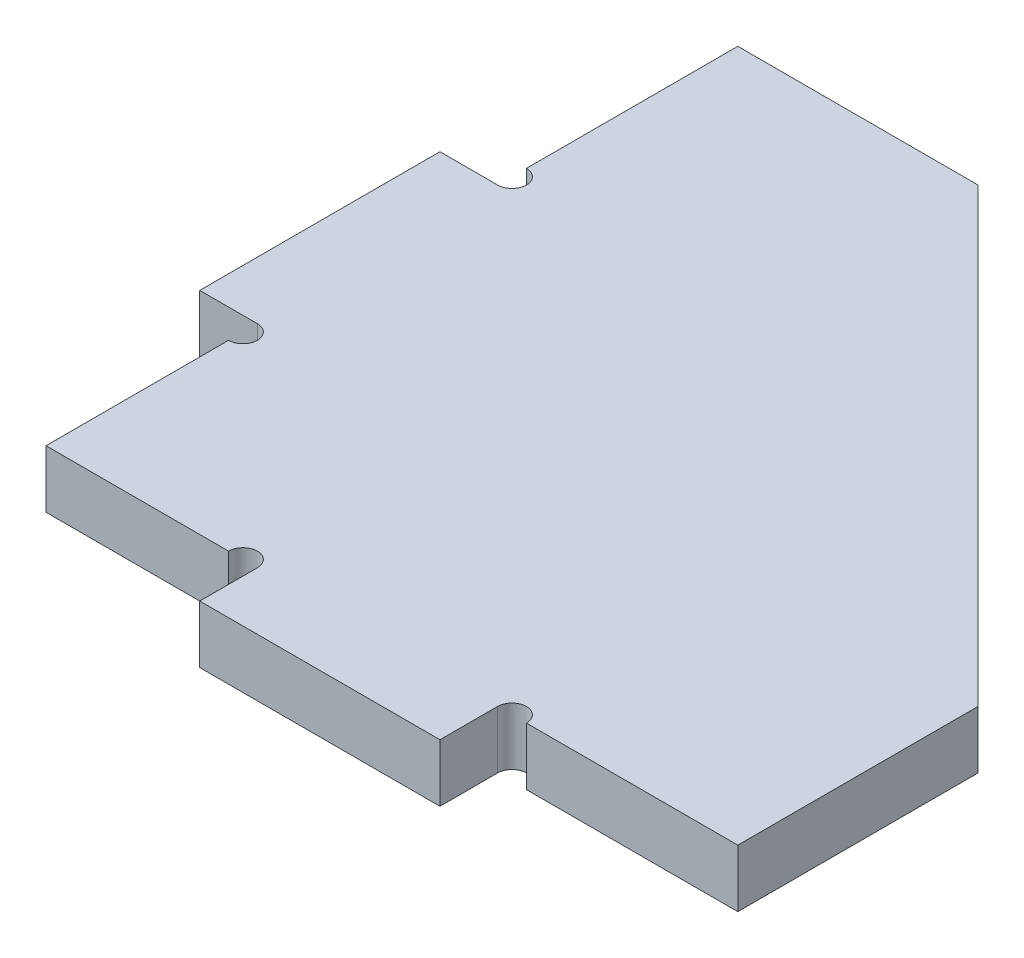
from build123d import *

# Parameters (mm, degrees)
BOSS_EXTRUDE1_DEPTH = 12


with BuildPart() as part:
    # Sketch1 → Boss-Extrude1 (new body)
    with BuildSketch(Plane(origin=(0, 0, 0), x_dir=(1, 0, 0), z_dir=(0, 1, 0))):
        with BuildLine():
            Line((0, 144), (0, 100))
            ThreePointArc((0, 100), (3, 97), (0, 94))
            Line((0, 94), (-12, 94))
            Line((-12, 94), (-12, 44))
            Line((-12, 44), (0, 44))
            ThreePointArc((0, 44), (3, 41), (0, 38))
            Line((0, 38), (0, 0))
            Line((0, 0), (38, 0))
            ThreePointArc((38, 0), (41, 3), (44, 0))
            Line((44, 0), (44, -12))
            Line((44, -12), (94, -12))
            Line((94, -12), (94, 0))
            ThreePointArc((94, 0), (97, 3), (100, 0))
            Line((100, 0), (144, 0))
            Line((144, 0), (144, 50))
            Line((144, 50), (50, 144))
            Line((50, 144), (0, 144))
        make_face()
    extrude(amount=BOSS_EXTRUDE1_DEPTH)


solid = part.part
